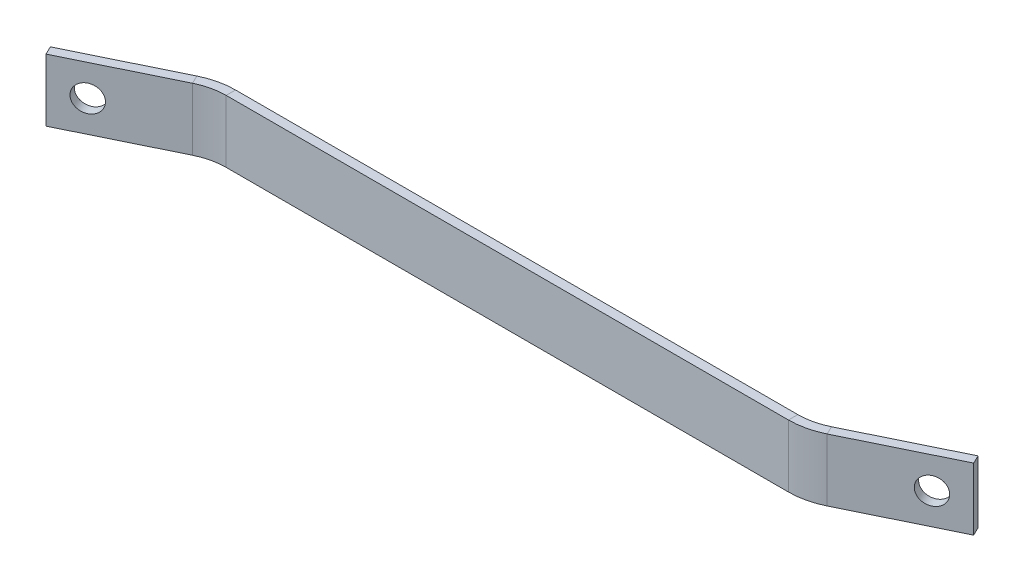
ISO-10303-21;
HEADER;
FILE_DESCRIPTION(('STEP AP214'),'2;1');
FILE_NAME('part.step','',(''),(''),'','','');
FILE_SCHEMA(('AUTOMOTIVE_DESIGN { 1 0 10303 214 1 1 1 1 }'));
ENDSEC;
DATA;
#1=APPLICATION_CONTEXT('core data for automotive mechanical design processes');
#2=APPLICATION_PROTOCOL_DEFINITION('international standard','automotive_design',2000,#1);
#3=PRODUCT_CONTEXT('',#1,'mechanical');
#4=PRODUCT('Part','Part','',(#3));
#5=PRODUCT_RELATED_PRODUCT_CATEGORY('part','',(#4));
#6=PRODUCT_DEFINITION_FORMATION('','',#4);
#7=PRODUCT_DEFINITION_CONTEXT('part definition',#1,'design');
#8=PRODUCT_DEFINITION('design','',#6,#7);
#9=PRODUCT_DEFINITION_SHAPE('','',#8);
#10=(LENGTH_UNIT() NAMED_UNIT(*) SI_UNIT(.MILLI.,.METRE.));
#11=(NAMED_UNIT(*) PLANE_ANGLE_UNIT() SI_UNIT($,.RADIAN.));
#12=(NAMED_UNIT(*) SI_UNIT($,.STERADIAN.) SOLID_ANGLE_UNIT());
#13=UNCERTAINTY_MEASURE_WITH_UNIT(LENGTH_MEASURE(1.E-05),#10,'distance_accuracy_value','');
#14=(GEOMETRIC_REPRESENTATION_CONTEXT(3) GLOBAL_UNCERTAINTY_ASSIGNED_CONTEXT((#13)) GLOBAL_UNIT_ASSIGNED_CONTEXT((#10,
#11,#12)) REPRESENTATION_CONTEXT('',''));
#15=CARTESIAN_POINT('',(0.,0.,0.));
#16=DIRECTION('',(0.,0.,1.));
#17=DIRECTION('',(1.,0.,0.));
#18=AXIS2_PLACEMENT_3D('',#15,#16,#17);
#19=CARTESIAN_POINT('',(247.783669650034,0.,-10.3404112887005));
#20=DIRECTION('',(-0.438371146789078,0.,-0.898794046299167));
#21=DIRECTION('',(-0.898794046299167,0.,0.438371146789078));
#22=AXIS2_PLACEMENT_3D('',#19,#20,#21);
#23=CYLINDRICAL_SURFACE('',#22,4.24999999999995);
#24=CARTESIAN_POINT('',(247.783669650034,0.,-10.3404112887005));
#25=DIRECTION('',(0.438371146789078,0.,0.898794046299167));
#26=DIRECTION('',(0.898794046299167,0.,-0.438371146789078));
#27=AXIS2_PLACEMENT_3D('',#24,#25,#26);
#28=CIRCLE('',#27,4.24999999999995);
#29=CARTESIAN_POINT('',(251.603544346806,0.,-12.2034886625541));
#30=VERTEX_POINT('',#29);
#31=EDGE_CURVE('E214',#30,#30,#28,.T.);
#32=ORIENTED_EDGE('',*,*,#31,.T.);
#33=EDGE_LOOP('',(#32));
#34=FACE_BOUND('',#33,.T.);
#35=CARTESIAN_POINT('',(246.468556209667,0.,-13.036793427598));
#36=DIRECTION('',(0.438371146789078,0.,0.898794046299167));
#37=DIRECTION('',(0.898794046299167,0.,-0.438371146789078));
#38=AXIS2_PLACEMENT_3D('',#35,#36,#37);
#39=CIRCLE('',#38,4.24999999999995);
#40=CARTESIAN_POINT('',(250.288430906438,0.,-14.8998708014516));
#41=VERTEX_POINT('',#40);
#42=EDGE_CURVE('E11',#41,#41,#39,.T.);
#43=ORIENTED_EDGE('',*,*,#42,.F.);
#44=EDGE_LOOP('',(#43));
#45=FACE_BOUND('',#44,.T.);
#46=ADVANCED_FACE('F30',(#34,#45),#23,.F.);
#47=CARTESIAN_POINT('',(256.771610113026,10.,-14.7241227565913));
#48=DIRECTION('',(0.898794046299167,0.,-0.438371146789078));
#49=DIRECTION('',(-0.438371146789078,0.,-0.898794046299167));
#50=AXIS2_PLACEMENT_3D('',#47,#48,#49);
#51=PLANE('',#50);
#52=DIRECTION('',(0.,-1.,0.));
#53=VECTOR('',#52,1.);
#54=CARTESIAN_POINT('',(255.456496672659,10.,-17.4205048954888));
#55=LINE('',#54,#53);
#56=CARTESIAN_POINT('',(255.456496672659,10.,-17.4205048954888));
#57=VERTEX_POINT('',#56);
#58=CARTESIAN_POINT('',(255.456496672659,-10.,-17.4205048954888));
#59=VERTEX_POINT('',#58);
#60=EDGE_CURVE('E40',#57,#59,#55,.T.);
#61=ORIENTED_EDGE('',*,*,#60,.F.);
#62=DIRECTION('',(-0.438371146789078,0.,-0.898794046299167));
#63=VECTOR('',#62,1.);
#64=CARTESIAN_POINT('',(256.771610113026,10.,-14.7241227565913));
#65=LINE('',#64,#63);
#66=CARTESIAN_POINT('',(256.771610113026,10.,-14.7241227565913));
#67=VERTEX_POINT('',#66);
#68=EDGE_CURVE('E204',#67,#57,#65,.T.);
#69=ORIENTED_EDGE('',*,*,#68,.F.);
#70=DIRECTION('',(0.,-1.,0.));
#71=VECTOR('',#70,1.);
#72=CARTESIAN_POINT('',(256.771610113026,10.,-14.7241227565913));
#73=LINE('',#72,#71);
#74=CARTESIAN_POINT('',(256.771610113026,-10.,-14.7241227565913));
#75=VERTEX_POINT('',#74);
#76=EDGE_CURVE('E211',#67,#75,#73,.T.);
#77=ORIENTED_EDGE('',*,*,#76,.T.);
#78=DIRECTION('',(-0.438371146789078,0.,-0.898794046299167));
#79=VECTOR('',#78,1.);
#80=CARTESIAN_POINT('',(256.771610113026,-10.,-14.7241227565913));
#81=LINE('',#80,#79);
#82=EDGE_CURVE('E208',#75,#59,#81,.T.);
#83=ORIENTED_EDGE('',*,*,#82,.T.);
#84=EDGE_LOOP('',(#61,#69,#77,#83));
#85=FACE_BOUND('',#84,.T.);
#86=ADVANCED_FACE('F303',(#85),#51,.T.);
#87=CARTESIAN_POINT('',(14.0972176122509,10.,103.63608687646));
#88=DIRECTION('',(0.,1.,0.));
#89=DIRECTION('',(0.438371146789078,0.,0.898794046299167));
#90=AXIS2_PLACEMENT_3D('',#87,#88,#89);
#91=PLANE('',#90);
#92=DIRECTION('',(0.898794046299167,0.,-0.438371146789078));
#93=VECTOR('',#92,1.);
#94=CARTESIAN_POINT('',(12.7821041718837,10.,100.939704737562));
#95=LINE('',#94,#93);
#96=CARTESIAN_POINT('',(223.889227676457,10.,-2.02411907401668));
#97=VERTEX_POINT('',#96);
#98=EDGE_CURVE('E49',#97,#57,#95,.T.);
#99=ORIENTED_EDGE('',*,*,#98,.F.);
#100=DIRECTION('',(0.438371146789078,0.,0.898794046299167));
#101=VECTOR('',#100,1.);
#102=CARTESIAN_POINT('',(225.204341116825,10.,0.672263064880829));
#103=LINE('',#102,#101);
#104=CARTESIAN_POINT('',(225.204341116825,10.,0.672263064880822));
#105=VERTEX_POINT('',#104);
#106=EDGE_CURVE('E168',#97,#105,#103,.T.);
#107=ORIENTED_EDGE('',*,*,#106,.T.);
#108=DIRECTION('',(0.898794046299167,0.,-0.438371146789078));
#109=VECTOR('',#108,1.);
#110=CARTESIAN_POINT('',(14.0972176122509,10.,103.63608687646));
#111=LINE('',#110,#109);
#112=EDGE_CURVE('E72',#105,#67,#111,.T.);
#113=ORIENTED_EDGE('',*,*,#112,.T.);
#114=ORIENTED_EDGE('',*,*,#68,.T.);
#115=EDGE_LOOP('',(#99,#107,#113,#114));
#116=FACE_BOUND('',#115,.T.);
#117=ADVANCED_FACE('F309',(#116),#91,.T.);
#118=CARTESIAN_POINT('',(14.0972176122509,-10.,103.63608687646));
#119=DIRECTION('',(0.438371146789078,0.,0.898794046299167));
#120=DIRECTION('',(0.898794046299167,0.,-0.438371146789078));
#121=AXIS2_PLACEMENT_3D('',#118,#119,#120);
#122=PLANE('',#121);
#123=ORIENTED_EDGE('',*,*,#31,.F.);
#124=EDGE_LOOP('',(#123));
#125=FACE_BOUND('',#124,.T.);
#126=ORIENTED_EDGE('',*,*,#112,.F.);
#127=DIRECTION('',(0.,-1.,0.));
#128=VECTOR('',#127,1.);
#129=CARTESIAN_POINT('',(225.204341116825,-10.,0.672263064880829));
#130=LINE('',#129,#128);
#131=CARTESIAN_POINT('',(225.204341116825,-10.,0.672263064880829));
#132=VERTEX_POINT('',#131);
#133=EDGE_CURVE('E201',#105,#132,#130,.T.);
#134=ORIENTED_EDGE('',*,*,#133,.T.);
#135=DIRECTION('',(0.898794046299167,0.,-0.438371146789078));
#136=VECTOR('',#135,1.);
#137=CARTESIAN_POINT('',(14.0972176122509,-10.,103.63608687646));
#138=LINE('',#137,#136);
#139=EDGE_CURVE('E199',#132,#75,#138,.T.);
#140=ORIENTED_EDGE('',*,*,#139,.T.);
#141=ORIENTED_EDGE('',*,*,#76,.F.);
#142=EDGE_LOOP('',(#126,#134,#140,#141));
#143=FACE_BOUND('',#142,.T.);
#144=ADVANCED_FACE('F317',(#125,#143),#122,.T.);
#145=CARTESIAN_POINT('',(14.0972176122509,-10.,103.63608687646));
#146=DIRECTION('',(0.,1.,0.));
#147=DIRECTION('',(0.438371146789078,0.,0.898794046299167));
#148=AXIS2_PLACEMENT_3D('',#145,#146,#147);
#149=PLANE('',#148);
#150=DIRECTION('',(0.438371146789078,0.,0.898794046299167));
#151=VECTOR('',#150,1.);
#152=CARTESIAN_POINT('',(225.204341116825,-10.,0.672263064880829));
#153=LINE('',#152,#151);
#154=CARTESIAN_POINT('',(223.889227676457,-10.,-2.02411907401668));
#155=VERTEX_POINT('',#154);
#156=EDGE_CURVE('E216',#155,#132,#153,.T.);
#157=ORIENTED_EDGE('',*,*,#156,.F.);
#158=DIRECTION('',(0.898794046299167,0.,-0.438371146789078));
#159=VECTOR('',#158,1.);
#160=CARTESIAN_POINT('',(12.7821041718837,-10.,100.939704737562));
#161=LINE('',#160,#159);
#162=EDGE_CURVE('E197',#155,#59,#161,.T.);
#163=ORIENTED_EDGE('',*,*,#162,.T.);
#164=ORIENTED_EDGE('',*,*,#82,.F.);
#165=ORIENTED_EDGE('',*,*,#139,.F.);
#166=EDGE_LOOP('',(#157,#163,#164,#165));
#167=FACE_BOUND('',#166,.T.);
#168=ADVANCED_FACE('F319',(#167),#149,.F.);
#169=CARTESIAN_POINT('',(12.7821041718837,-10.,100.939704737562));
#170=DIRECTION('',(0.438371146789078,0.,0.898794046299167));
#171=DIRECTION('',(0.898794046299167,0.,-0.438371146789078));
#172=AXIS2_PLACEMENT_3D('',#169,#170,#171);
#173=PLANE('',#172);
#174=DIRECTION('',(0.,-1.,0.));
#175=VECTOR('',#174,1.);
#176=CARTESIAN_POINT('',(223.889227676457,-10.,-2.02411907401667));
#177=LINE('',#176,#175);
#178=EDGE_CURVE('E34',#97,#155,#177,.T.);
#179=ORIENTED_EDGE('',*,*,#178,.F.);
#180=ORIENTED_EDGE('',*,*,#98,.T.);
#181=ORIENTED_EDGE('',*,*,#60,.T.);
#182=ORIENTED_EDGE('',*,*,#162,.F.);
#183=EDGE_LOOP('',(#179,#180,#181,#182));
#184=FACE_BOUND('',#183,.T.);
#185=ORIENTED_EDGE('',*,*,#42,.T.);
#186=EDGE_LOOP('',(#185));
#187=FACE_BOUND('',#186,.T.);
#188=ADVANCED_FACE('F32',(#184,#187),#173,.F.);
#189=CARTESIAN_POINT('',(3.53144379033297,0.,16.036793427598));
#190=DIRECTION('',(-0.438371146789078,0.,-0.898794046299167));
#191=DIRECTION('',(-0.898794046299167,0.,0.438371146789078));
#192=AXIS2_PLACEMENT_3D('',#189,#190,#191);
#193=CYLINDRICAL_SURFACE('',#192,4.25);
#194=CARTESIAN_POINT('',(3.53144379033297,0.,16.036793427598));
#195=DIRECTION('',(0.438371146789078,0.,0.898794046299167));
#196=DIRECTION('',(0.898794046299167,0.,-0.438371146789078));
#197=AXIS2_PLACEMENT_3D('',#194,#195,#196);
#198=CIRCLE('',#197,4.25);
#199=CARTESIAN_POINT('',(7.35131848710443,0.,14.1737160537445));
#200=VERTEX_POINT('',#199);
#201=EDGE_CURVE('E245',#200,#200,#198,.T.);
#202=ORIENTED_EDGE('',*,*,#201,.T.);
#203=EDGE_LOOP('',(#202));
#204=FACE_BOUND('',#203,.T.);
#205=CARTESIAN_POINT('',(2.21633034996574,0.,13.3404112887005));
#206=DIRECTION('',(0.438371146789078,0.,0.898794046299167));
#207=DIRECTION('',(0.898794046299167,0.,-0.438371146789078));
#208=AXIS2_PLACEMENT_3D('',#205,#206,#207);
#209=CIRCLE('',#208,4.25);
#210=CARTESIAN_POINT('',(6.03620504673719,0.,11.477333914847));
#211=VERTEX_POINT('',#210);
#212=EDGE_CURVE('E230',#211,#211,#209,.T.);
#213=ORIENTED_EDGE('',*,*,#212,.F.);
#214=EDGE_LOOP('',(#213));
#215=FACE_BOUND('',#214,.T.);
#216=ADVANCED_FACE('F326',(#204,#215),#193,.F.);
#217=CARTESIAN_POINT('',(-5.4564966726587,10.,20.4205048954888));
#218=DIRECTION('',(0.898794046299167,0.,-0.438371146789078));
#219=DIRECTION('',(0.,1.,0.));
#220=AXIS2_PLACEMENT_3D('',#217,#218,#219);
#221=PLANE('',#220);
#222=DIRECTION('',(0.,-1.,0.));
#223=VECTOR('',#222,1.);
#224=CARTESIAN_POINT('',(-6.77161011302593,10.,17.7241227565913));
#225=LINE('',#224,#223);
#226=CARTESIAN_POINT('',(-6.77161011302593,10.,17.7241227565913));
#227=VERTEX_POINT('',#226);
#228=CARTESIAN_POINT('',(-6.77161011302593,-10.,17.7241227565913));
#229=VERTEX_POINT('',#228);
#230=EDGE_CURVE('E242',#227,#229,#225,.T.);
#231=ORIENTED_EDGE('',*,*,#230,.T.);
#232=DIRECTION('',(-0.438371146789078,0.,-0.898794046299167));
#233=VECTOR('',#232,1.);
#234=CARTESIAN_POINT('',(-5.45649667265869,-10.,20.4205048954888));
#235=LINE('',#234,#233);
#236=CARTESIAN_POINT('',(-5.45649667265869,-10.,20.4205048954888));
#237=VERTEX_POINT('',#236);
#238=EDGE_CURVE('E228',#237,#229,#235,.T.);
#239=ORIENTED_EDGE('',*,*,#238,.F.);
#240=DIRECTION('',(0.,-1.,0.));
#241=VECTOR('',#240,1.);
#242=CARTESIAN_POINT('',(-5.4564966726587,10.,20.4205048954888));
#243=LINE('',#242,#241);
#244=CARTESIAN_POINT('',(-5.4564966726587,10.,20.4205048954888));
#245=VERTEX_POINT('',#244);
#246=EDGE_CURVE('E218',#245,#237,#243,.T.);
#247=ORIENTED_EDGE('',*,*,#246,.F.);
#248=DIRECTION('',(-0.438371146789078,0.,-0.898794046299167));
#249=VECTOR('',#248,1.);
#250=CARTESIAN_POINT('',(-5.4564966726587,10.,20.4205048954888));
#251=LINE('',#250,#249);
#252=EDGE_CURVE('E240',#245,#227,#251,.T.);
#253=ORIENTED_EDGE('',*,*,#252,.T.);
#254=EDGE_LOOP('',(#231,#239,#247,#253));
#255=FACE_BOUND('',#254,.T.);
#256=ADVANCED_FACE('F459',(#255),#221,.F.);
#257=CARTESIAN_POINT('',(-5.4564966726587,10.,20.4205048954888));
#258=DIRECTION('',(0.,1.,0.));
#259=DIRECTION('',(0.438371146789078,0.,0.898794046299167));
#260=AXIS2_PLACEMENT_3D('',#257,#258,#259);
#261=PLANE('',#260);
#262=DIRECTION('',(0.898794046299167,0.,-0.438371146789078));
#263=VECTOR('',#262,1.);
#264=CARTESIAN_POINT('',(-5.4564966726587,10.,20.4205048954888));
#265=LINE('',#264,#263);
#266=CARTESIAN_POINT('',(26.1107723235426,10.,5.02411907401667));
#267=VERTEX_POINT('',#266);
#268=EDGE_CURVE('E238',#245,#267,#265,.T.);
#269=ORIENTED_EDGE('',*,*,#268,.T.);
#270=DIRECTION('',(-0.438371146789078,0.,-0.898794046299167));
#271=VECTOR('',#270,1.);
#272=CARTESIAN_POINT('',(26.1107723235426,10.,5.02411907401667));
#273=LINE('',#272,#271);
#274=CARTESIAN_POINT('',(24.7956588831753,10.,2.32773693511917));
#275=VERTEX_POINT('',#274);
#276=EDGE_CURVE('E235',#267,#275,#273,.T.);
#277=ORIENTED_EDGE('',*,*,#276,.T.);
#278=DIRECTION('',(0.898794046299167,0.,-0.438371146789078));
#279=VECTOR('',#278,1.);
#280=CARTESIAN_POINT('',(-6.77161011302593,10.,17.7241227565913));
#281=LINE('',#280,#279);
#282=EDGE_CURVE('E233',#227,#275,#281,.T.);
#283=ORIENTED_EDGE('',*,*,#282,.F.);
#284=ORIENTED_EDGE('',*,*,#252,.F.);
#285=EDGE_LOOP('',(#269,#277,#283,#284));
#286=FACE_BOUND('',#285,.T.);
#287=ADVANCED_FACE('F287',(#286),#261,.T.);
#288=CARTESIAN_POINT('',(-6.77161011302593,-10.,17.7241227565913));
#289=DIRECTION('',(0.438371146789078,0.,0.898794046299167));
#290=DIRECTION('',(0.898794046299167,0.,-0.438371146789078));
#291=AXIS2_PLACEMENT_3D('',#288,#289,#290);
#292=PLANE('',#291);
#293=DIRECTION('',(0.,1.,0.));
#294=VECTOR('',#293,1.);
#295=CARTESIAN_POINT('',(24.7956588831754,-10.,2.32773693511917));
#296=LINE('',#295,#294);
#297=CARTESIAN_POINT('',(24.7956588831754,-10.,2.32773693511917));
#298=VERTEX_POINT('',#297);
#299=EDGE_CURVE('E101',#298,#275,#296,.T.);
#300=ORIENTED_EDGE('',*,*,#299,.F.);
#301=DIRECTION('',(0.898794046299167,0.,-0.438371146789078));
#302=VECTOR('',#301,1.);
#303=CARTESIAN_POINT('',(-6.77161011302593,-10.,17.7241227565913));
#304=LINE('',#303,#302);
#305=EDGE_CURVE('E226',#229,#298,#304,.T.);
#306=ORIENTED_EDGE('',*,*,#305,.F.);
#307=ORIENTED_EDGE('',*,*,#230,.F.);
#308=ORIENTED_EDGE('',*,*,#282,.T.);
#309=EDGE_LOOP('',(#300,#306,#307,#308));
#310=FACE_BOUND('',#309,.T.);
#311=ORIENTED_EDGE('',*,*,#212,.T.);
#312=EDGE_LOOP('',(#311));
#313=FACE_BOUND('',#312,.T.);
#314=ADVANCED_FACE('F298',(#310,#313),#292,.F.);
#315=CARTESIAN_POINT('',(-5.45649667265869,-10.,20.4205048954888));
#316=DIRECTION('',(0.,1.,0.));
#317=DIRECTION('',(0.438371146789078,0.,0.898794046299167));
#318=AXIS2_PLACEMENT_3D('',#315,#316,#317);
#319=PLANE('',#318);
#320=DIRECTION('',(-0.438371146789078,0.,-0.898794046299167));
#321=VECTOR('',#320,1.);
#322=CARTESIAN_POINT('',(26.1107723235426,-10.,5.02411907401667));
#323=LINE('',#322,#321);
#324=CARTESIAN_POINT('',(26.1107723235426,-10.,5.02411907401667));
#325=VERTEX_POINT('',#324);
#326=EDGE_CURVE('E178',#325,#298,#323,.T.);
#327=ORIENTED_EDGE('',*,*,#326,.F.);
#328=DIRECTION('',(0.898794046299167,0.,-0.438371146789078));
#329=VECTOR('',#328,1.);
#330=CARTESIAN_POINT('',(-5.45649667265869,-10.,20.4205048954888));
#331=LINE('',#330,#329);
#332=EDGE_CURVE('E81',#237,#325,#331,.T.);
#333=ORIENTED_EDGE('',*,*,#332,.F.);
#334=ORIENTED_EDGE('',*,*,#238,.T.);
#335=ORIENTED_EDGE('',*,*,#305,.T.);
#336=EDGE_LOOP('',(#327,#333,#334,#335));
#337=FACE_BOUND('',#336,.T.);
#338=ADVANCED_FACE('F290',(#337),#319,.F.);
#339=CARTESIAN_POINT('',(-5.45649667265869,-10.,20.4205048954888));
#340=DIRECTION('',(0.438371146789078,0.,0.898794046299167));
#341=DIRECTION('',(0.898794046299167,0.,-0.438371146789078));
#342=AXIS2_PLACEMENT_3D('',#339,#340,#341);
#343=PLANE('',#342);
#344=ORIENTED_EDGE('',*,*,#201,.F.);
#345=EDGE_LOOP('',(#344));
#346=FACE_BOUND('',#345,.T.);
#347=ORIENTED_EDGE('',*,*,#332,.T.);
#348=DIRECTION('',(0.,1.,0.));
#349=VECTOR('',#348,1.);
#350=CARTESIAN_POINT('',(26.1107723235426,-10.,5.02411907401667));
#351=LINE('',#350,#349);
#352=EDGE_CURVE('E107',#325,#267,#351,.T.);
#353=ORIENTED_EDGE('',*,*,#352,.T.);
#354=ORIENTED_EDGE('',*,*,#268,.F.);
#355=ORIENTED_EDGE('',*,*,#246,.T.);
#356=EDGE_LOOP('',(#347,#353,#354,#355));
#357=FACE_BOUND('',#356,.T.);
#358=ADVANCED_FACE('F288',(#346,#357),#343,.T.);
#359=CARTESIAN_POINT('',(-10.,-10.,0.));
#360=DIRECTION('',(0.,0.,1.));
#361=DIRECTION('',(1.,0.,0.));
#362=AXIS2_PLACEMENT_3D('',#359,#360,#361);
#363=PLANE('',#362);
#364=DIRECTION('',(1.,0.,0.));
#365=VECTOR('',#364,1.);
#366=CARTESIAN_POINT('',(-10.,10.,0.));
#367=LINE('',#366,#365);
#368=CARTESIAN_POINT('',(34.8781952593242,10.,0.));
#369=VERTEX_POINT('',#368);
#370=CARTESIAN_POINT('',(215.121804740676,10.,0.));
#371=VERTEX_POINT('',#370);
#372=EDGE_CURVE('E175',#369,#371,#367,.T.);
#373=ORIENTED_EDGE('',*,*,#372,.T.);
#374=DIRECTION('',(0.,-1.,0.));
#375=VECTOR('',#374,1.);
#376=CARTESIAN_POINT('',(215.121804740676,-10.,0.));
#377=LINE('',#376,#375);
#378=CARTESIAN_POINT('',(215.121804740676,-10.,0.));
#379=VERTEX_POINT('',#378);
#380=EDGE_CURVE('E149',#371,#379,#377,.T.);
#381=ORIENTED_EDGE('',*,*,#380,.T.);
#382=DIRECTION('',(1.,0.,0.));
#383=VECTOR('',#382,1.);
#384=CARTESIAN_POINT('',(-10.,-10.,0.));
#385=LINE('',#384,#383);
#386=CARTESIAN_POINT('',(34.8781952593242,-10.,0.));
#387=VERTEX_POINT('',#386);
#388=EDGE_CURVE('E184',#387,#379,#385,.T.);
#389=ORIENTED_EDGE('',*,*,#388,.F.);
#390=DIRECTION('',(0.,1.,0.));
#391=VECTOR('',#390,1.);
#392=CARTESIAN_POINT('',(34.8781952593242,-10.,0.));
#393=LINE('',#392,#391);
#394=EDGE_CURVE('E182',#387,#369,#393,.T.);
#395=ORIENTED_EDGE('',*,*,#394,.T.);
#396=EDGE_LOOP('',(#373,#381,#389,#395));
#397=FACE_BOUND('',#396,.T.);
#398=ADVANCED_FACE('F181',(#397),#363,.F.);
#399=CARTESIAN_POINT('',(-10.,-10.,3.));
#400=DIRECTION('',(0.,1.,0.));
#401=DIRECTION('',(0.,0.,1.));
#402=AXIS2_PLACEMENT_3D('',#399,#400,#401);
#403=PLANE('',#402);
#404=ORIENTED_EDGE('',*,*,#388,.T.);
#405=DIRECTION('',(0.,0.,1.));
#406=VECTOR('',#405,1.);
#407=CARTESIAN_POINT('',(215.121804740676,-10.,3.));
#408=LINE('',#407,#406);
#409=CARTESIAN_POINT('',(215.121804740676,-10.,3.));
#410=VERTEX_POINT('',#409);
#411=EDGE_CURVE('E160',#379,#410,#408,.T.);
#412=ORIENTED_EDGE('',*,*,#411,.T.);
#413=DIRECTION('',(1.,0.,0.));
#414=VECTOR('',#413,1.);
#415=CARTESIAN_POINT('',(-10.,-10.,3.));
#416=LINE('',#415,#414);
#417=CARTESIAN_POINT('',(34.8781952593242,-10.,3.));
#418=VERTEX_POINT('',#417);
#419=EDGE_CURVE('E183',#418,#410,#416,.T.);
#420=ORIENTED_EDGE('',*,*,#419,.F.);
#421=DIRECTION('',(0.,0.,-1.));
#422=VECTOR('',#421,1.);
#423=CARTESIAN_POINT('',(34.8781952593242,-10.,3.));
#424=LINE('',#423,#422);
#425=EDGE_CURVE('E193',#418,#387,#424,.T.);
#426=ORIENTED_EDGE('',*,*,#425,.T.);
#427=EDGE_LOOP('',(#404,#412,#420,#426));
#428=FACE_BOUND('',#427,.T.);
#429=ADVANCED_FACE('F275',(#428),#403,.F.);
#430=CARTESIAN_POINT('',(-10.,-10.,3.));
#431=DIRECTION('',(0.,0.,1.));
#432=DIRECTION('',(1.,0.,0.));
#433=AXIS2_PLACEMENT_3D('',#430,#431,#432);
#434=PLANE('',#433);
#435=DIRECTION('',(0.,-1.,0.));
#436=VECTOR('',#435,1.);
#437=CARTESIAN_POINT('',(215.121804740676,-10.,3.));
#438=LINE('',#437,#436);
#439=CARTESIAN_POINT('',(215.121804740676,10.,2.99999999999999));
#440=VERTEX_POINT('',#439);
#441=EDGE_CURVE('E159',#440,#410,#438,.T.);
#442=ORIENTED_EDGE('',*,*,#441,.F.);
#443=DIRECTION('',(1.,0.,0.));
#444=VECTOR('',#443,1.);
#445=CARTESIAN_POINT('',(-10.,10.,3.));
#446=LINE('',#445,#444);
#447=CARTESIAN_POINT('',(34.8781952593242,10.,3.));
#448=VERTEX_POINT('',#447);
#449=EDGE_CURVE('E177',#448,#440,#446,.T.);
#450=ORIENTED_EDGE('',*,*,#449,.F.);
#451=DIRECTION('',(0.,1.,0.));
#452=VECTOR('',#451,1.);
#453=CARTESIAN_POINT('',(34.8781952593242,-10.,3.));
#454=LINE('',#453,#452);
#455=EDGE_CURVE('E264',#418,#448,#454,.T.);
#456=ORIENTED_EDGE('',*,*,#455,.F.);
#457=ORIENTED_EDGE('',*,*,#419,.T.);
#458=EDGE_LOOP('',(#442,#450,#456,#457));
#459=FACE_BOUND('',#458,.T.);
#460=ADVANCED_FACE('F277',(#459),#434,.T.);
#461=CARTESIAN_POINT('',(-10.,10.,3.));
#462=DIRECTION('',(0.,1.,0.));
#463=DIRECTION('',(0.,0.,1.));
#464=AXIS2_PLACEMENT_3D('',#461,#462,#463);
#465=PLANE('',#464);
#466=DIRECTION('',(0.,0.,1.));
#467=VECTOR('',#466,1.);
#468=CARTESIAN_POINT('',(215.121804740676,10.,3.));
#469=LINE('',#468,#467);
#470=EDGE_CURVE('E166',#371,#440,#469,.T.);
#471=ORIENTED_EDGE('',*,*,#470,.F.);
#472=ORIENTED_EDGE('',*,*,#372,.F.);
#473=DIRECTION('',(0.,0.,-1.));
#474=VECTOR('',#473,1.);
#475=CARTESIAN_POINT('',(34.8781952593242,10.,3.));
#476=LINE('',#475,#474);
#477=EDGE_CURVE('E266',#448,#369,#476,.T.);
#478=ORIENTED_EDGE('',*,*,#477,.F.);
#479=ORIENTED_EDGE('',*,*,#449,.T.);
#480=EDGE_LOOP('',(#471,#472,#478,#479));
#481=FACE_BOUND('',#480,.T.);
#482=ADVANCED_FACE('F173',(#481),#465,.T.);
#483=CARTESIAN_POINT('',(34.8781952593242,10.,23.));
#484=DIRECTION('',(0.,1.,0.));
#485=DIRECTION('',(0.,0.,1.));
#486=AXIS2_PLACEMENT_3D('',#483,#484,#485);
#487=PLANE('',#486);
#488=ORIENTED_EDGE('',*,*,#276,.F.);
#489=CARTESIAN_POINT('',(34.8781952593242,10.,23.));
#490=DIRECTION('',(0.,-1.,0.));
#491=DIRECTION('',(0.,0.,-1.));
#492=AXIS2_PLACEMENT_3D('',#489,#490,#491);
#493=CIRCLE('',#492,20.);
#494=EDGE_CURVE('E255',#267,#448,#493,.T.);
#495=ORIENTED_EDGE('',*,*,#494,.T.);
#496=ORIENTED_EDGE('',*,*,#477,.T.);
#497=CARTESIAN_POINT('',(34.8781952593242,10.,23.));
#498=DIRECTION('',(0.,-1.,0.));
#499=DIRECTION('',(0.,0.,-1.));
#500=AXIS2_PLACEMENT_3D('',#497,#498,#499);
#501=CIRCLE('',#500,23.);
#502=EDGE_CURVE('E188',#275,#369,#501,.T.);
#503=ORIENTED_EDGE('',*,*,#502,.F.);
#504=EDGE_LOOP('',(#488,#495,#496,#503));
#505=FACE_BOUND('',#504,.T.);
#506=ADVANCED_FACE('F283',(#505),#487,.T.);
#507=CARTESIAN_POINT('',(34.8781952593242,-10.,23.));
#508=DIRECTION('',(0.,1.,0.));
#509=DIRECTION('',(0.,0.,1.));
#510=AXIS2_PLACEMENT_3D('',#507,#508,#509);
#511=PLANE('',#510);
#512=ORIENTED_EDGE('',*,*,#425,.F.);
#513=CARTESIAN_POINT('',(34.8781952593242,-10.,23.));
#514=DIRECTION('',(0.,-1.,0.));
#515=DIRECTION('',(0.,0.,-1.));
#516=AXIS2_PLACEMENT_3D('',#513,#514,#515);
#517=CIRCLE('',#516,20.);
#518=EDGE_CURVE('E252',#325,#418,#517,.T.);
#519=ORIENTED_EDGE('',*,*,#518,.F.);
#520=ORIENTED_EDGE('',*,*,#326,.T.);
#521=CARTESIAN_POINT('',(34.8781952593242,-10.,23.));
#522=DIRECTION('',(0.,-1.,0.));
#523=DIRECTION('',(0.,0.,-1.));
#524=AXIS2_PLACEMENT_3D('',#521,#522,#523);
#525=CIRCLE('',#524,23.);
#526=EDGE_CURVE('E118',#298,#387,#525,.T.);
#527=ORIENTED_EDGE('',*,*,#526,.T.);
#528=EDGE_LOOP('',(#512,#519,#520,#527));
#529=FACE_BOUND('',#528,.T.);
#530=ADVANCED_FACE('F250',(#529),#511,.F.);
#531=CARTESIAN_POINT('',(34.8781952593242,280.756348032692,23.));
#532=DIRECTION('',(0.,-1.,0.));
#533=DIRECTION('',(0.,0.,-1.));
#534=AXIS2_PLACEMENT_3D('',#531,#532,#533);
#535=CYLINDRICAL_SURFACE('',#534,23.);
#536=ORIENTED_EDGE('',*,*,#526,.F.);
#537=ORIENTED_EDGE('',*,*,#299,.T.);
#538=ORIENTED_EDGE('',*,*,#502,.T.);
#539=ORIENTED_EDGE('',*,*,#394,.F.);
#540=EDGE_LOOP('',(#536,#537,#538,#539));
#541=FACE_BOUND('',#540,.T.);
#542=ADVANCED_FACE('F253',(#541),#535,.T.);
#543=CARTESIAN_POINT('',(34.8781952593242,280.756348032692,23.));
#544=DIRECTION('',(0.,-1.,0.));
#545=DIRECTION('',(0.,0.,-1.));
#546=AXIS2_PLACEMENT_3D('',#543,#544,#545);
#547=CYLINDRICAL_SURFACE('',#546,20.);
#548=ORIENTED_EDGE('',*,*,#518,.T.);
#549=ORIENTED_EDGE('',*,*,#455,.T.);
#550=ORIENTED_EDGE('',*,*,#494,.F.);
#551=ORIENTED_EDGE('',*,*,#352,.F.);
#552=EDGE_LOOP('',(#548,#549,#550,#551));
#553=FACE_BOUND('',#552,.T.);
#554=ADVANCED_FACE('F280',(#553),#547,.F.);
#555=CARTESIAN_POINT('',(215.121804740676,10.,-20.));
#556=DIRECTION('',(0.,-1.,0.));
#557=DIRECTION('',(0.,0.,-1.));
#558=AXIS2_PLACEMENT_3D('',#555,#556,#557);
#559=PLANE('',#558);
#560=ORIENTED_EDGE('',*,*,#106,.F.);
#561=CARTESIAN_POINT('',(215.121804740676,10.,-20.));
#562=DIRECTION('',(0.,-1.,0.));
#563=DIRECTION('',(0.,0.,-1.));
#564=AXIS2_PLACEMENT_3D('',#561,#562,#563);
#565=CIRCLE('',#564,20.);
#566=EDGE_CURVE('E152',#371,#97,#565,.F.);
#567=ORIENTED_EDGE('',*,*,#566,.F.);
#568=ORIENTED_EDGE('',*,*,#470,.T.);
#569=CARTESIAN_POINT('',(215.121804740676,10.,-20.));
#570=DIRECTION('',(0.,-1.,0.));
#571=DIRECTION('',(0.,0.,-1.));
#572=AXIS2_PLACEMENT_3D('',#569,#570,#571);
#573=CIRCLE('',#572,23.);
#574=EDGE_CURVE('E271',#440,#105,#573,.F.);
#575=ORIENTED_EDGE('',*,*,#574,.T.);
#576=EDGE_LOOP('',(#560,#567,#568,#575));
#577=FACE_BOUND('',#576,.T.);
#578=ADVANCED_FACE('F164',(#577),#559,.F.);
#579=CARTESIAN_POINT('',(215.121804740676,-10.,-20.));
#580=DIRECTION('',(0.,-1.,0.));
#581=DIRECTION('',(0.,0.,-1.));
#582=AXIS2_PLACEMENT_3D('',#579,#580,#581);
#583=PLANE('',#582);
#584=CARTESIAN_POINT('',(215.121804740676,-10.,-20.));
#585=DIRECTION('',(0.,-1.,0.));
#586=DIRECTION('',(0.,0.,-1.));
#587=AXIS2_PLACEMENT_3D('',#584,#585,#586);
#588=CIRCLE('',#587,20.);
#589=EDGE_CURVE('E154',#379,#155,#588,.F.);
#590=ORIENTED_EDGE('',*,*,#589,.T.);
#591=ORIENTED_EDGE('',*,*,#156,.T.);
#592=CARTESIAN_POINT('',(215.121804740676,-10.,-20.));
#593=DIRECTION('',(0.,-1.,0.));
#594=DIRECTION('',(0.,0.,-1.));
#595=AXIS2_PLACEMENT_3D('',#592,#593,#594);
#596=CIRCLE('',#595,23.);
#597=EDGE_CURVE('E65',#410,#132,#596,.F.);
#598=ORIENTED_EDGE('',*,*,#597,.F.);
#599=ORIENTED_EDGE('',*,*,#411,.F.);
#600=EDGE_LOOP('',(#590,#591,#598,#599));
#601=FACE_BOUND('',#600,.T.);
#602=ADVANCED_FACE('F337',(#601),#583,.T.);
#603=CARTESIAN_POINT('',(215.121804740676,278.298507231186,-20.));
#604=DIRECTION('',(0.,-1.,0.));
#605=DIRECTION('',(0.,0.,-1.));
#606=AXIS2_PLACEMENT_3D('',#603,#604,#605);
#607=CYLINDRICAL_SURFACE('',#606,23.);
#608=ORIENTED_EDGE('',*,*,#441,.T.);
#609=ORIENTED_EDGE('',*,*,#597,.T.);
#610=ORIENTED_EDGE('',*,*,#133,.F.);
#611=ORIENTED_EDGE('',*,*,#574,.F.);
#612=EDGE_LOOP('',(#608,#609,#610,#611));
#613=FACE_BOUND('',#612,.T.);
#614=ADVANCED_FACE('F270',(#613),#607,.T.);
#615=CARTESIAN_POINT('',(215.121804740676,278.298507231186,-20.));
#616=DIRECTION('',(0.,-1.,0.));
#617=DIRECTION('',(0.,0.,-1.));
#618=AXIS2_PLACEMENT_3D('',#615,#616,#617);
#619=CYLINDRICAL_SURFACE('',#618,20.);
#620=ORIENTED_EDGE('',*,*,#380,.F.);
#621=ORIENTED_EDGE('',*,*,#566,.T.);
#622=ORIENTED_EDGE('',*,*,#178,.T.);
#623=ORIENTED_EDGE('',*,*,#589,.F.);
#624=EDGE_LOOP('',(#620,#621,#622,#623));
#625=FACE_BOUND('',#624,.T.);
#626=ADVANCED_FACE('F151',(#625),#619,.F.);
#627=CLOSED_SHELL('',(#46,#86,#117,#144,#168,#188,#216,#256,#287,#314,#338,#358,#398,#429,#460,
#482,#506,#530,#542,#554,#578,#602,#614,#626));
#628=MANIFOLD_SOLID_BREP('B2',#627);
#629=ADVANCED_BREP_SHAPE_REPRESENTATION('',(#18,#628),#14);
#630=SHAPE_DEFINITION_REPRESENTATION(#9,#629);
ENDSEC;
END-ISO-10303-21;
